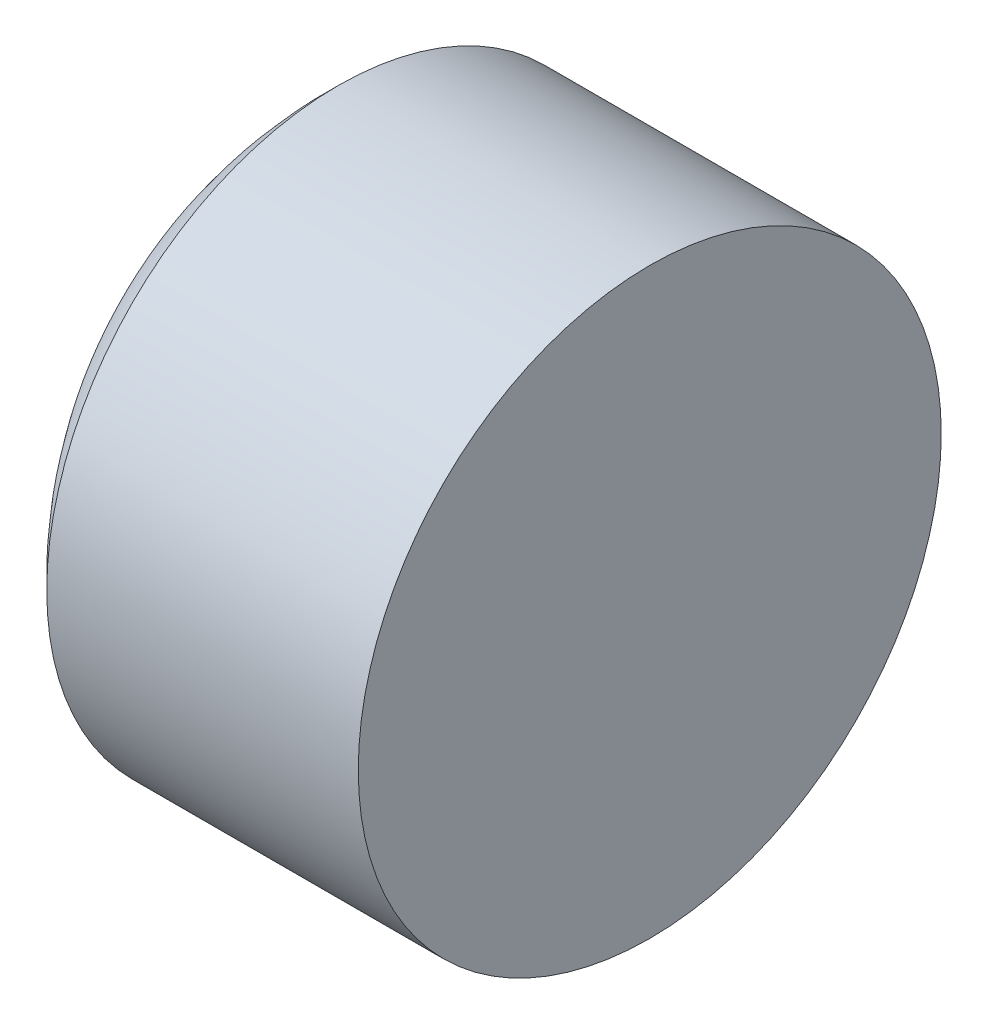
from build123d import *


with BuildPart() as part:
    # Sketch1 → Revolve1 (revolve)
    with BuildSketch(Plane.XY):
        with BuildLine():
            Line((-139.7, 0), (12.7, 0))
            Line((12.7, 0), (12.7, 101.6))
            Line((12.7, 101.6), (-95.882897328, 101.6))
            ThreePointArc((-95.882897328, 101.6), (-128.278857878, 55.322912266), (-139.7, 0))
        make_face()
    revolve(axis=Axis((0, 0, 0), (1, 0, 0)))


solid = part.part
